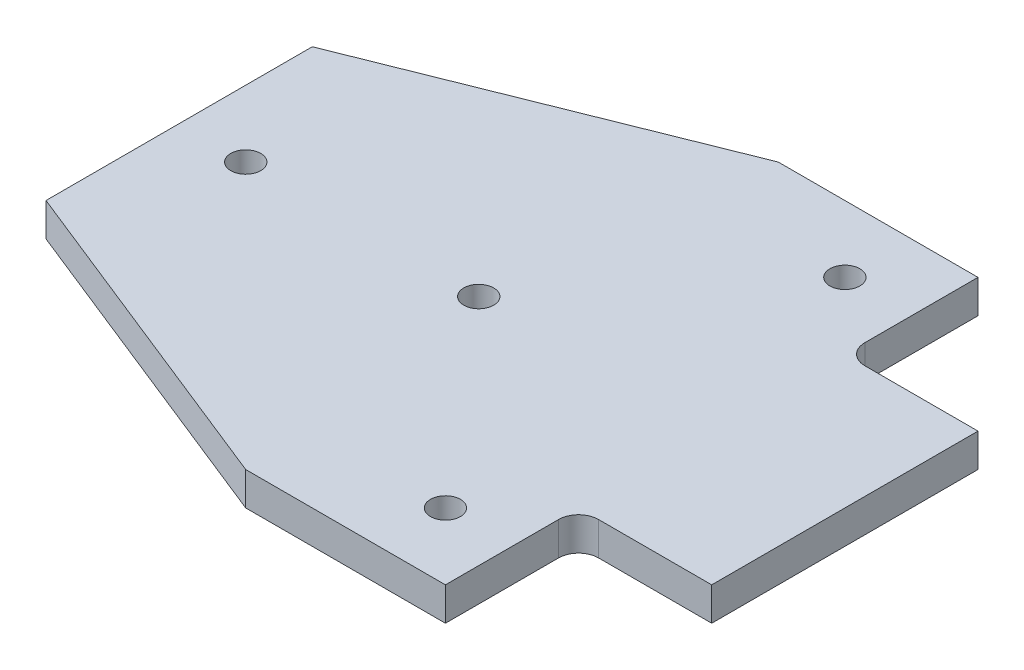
from build123d import *

# Parameters (mm, degrees)
SKETCH1_R      = 2.25
EXTRUDE1_DEPTH = 5


with BuildPart() as part:
    # Sketch1 → Extrude1 (new body)
    with BuildSketch(Plane(origin=(0, 0, 0), x_dir=(1, 0, 0), z_dir=(0, 1, 0))):
        with BuildLine():
            Line((100, -20), (100, 20))
            Line((100, 20), (83, 20))
            ThreePointArc((83, 20), (80.878679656, 20.878679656), (80, 23))
            Line((80, 23), (80, 40))
            Line((80, 40), (50, 40))
            Line((50, 40), (0, 20))
            Line((0, 20), (0, -20))
            Line((0, -20), (50, -40))
            Line((50, -40), (80, -40))
            Line((80, -40), (80, -23))
            ThreePointArc((80, -23), (80.878679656, -20.878679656), (83, -20))
            Line((83, -20), (100, -20))
        make_face()
        with Locations(Location((45, 0, 0), (0, 0, 270))):
            Circle(SKETCH1_R, mode=Mode.SUBTRACT)
        with Locations(Location((10, 0, 0), (0, 0, 270))):
            Circle(SKETCH1_R, mode=Mode.SUBTRACT)
        with Locations(Location((70, 30, 0), (0, 0, 270))):
            Circle(SKETCH1_R, mode=Mode.SUBTRACT)
        with Locations(Location((70, -30, 0), (0, 0, 90))):
            Circle(SKETCH1_R, mode=Mode.SUBTRACT)
    extrude(amount=EXTRUDE1_DEPTH)


solid = part.part
